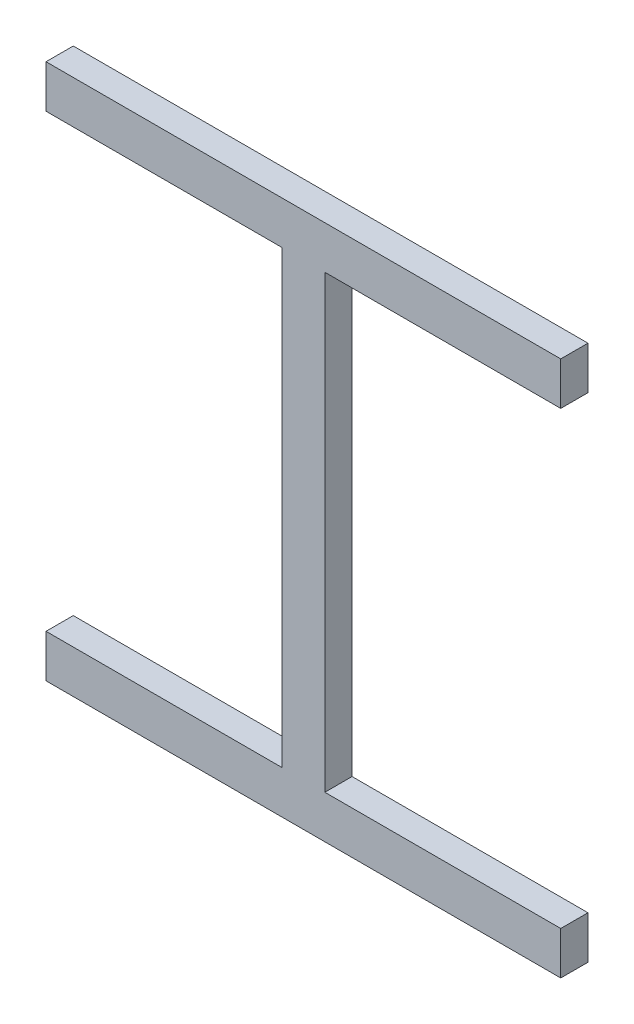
from build123d import *

# Parameters (mm, degrees)
BASESECTION_DEPTH = 12.7


with BuildPart() as part:
    # Sketch1 → BaseSection (new, symmetric)
    with BuildSketch(Plane.XY):
        Polygon((-240, -210), (-240, -250), (240, -250), (240, -210), (20, -210), (20, 210), (240, 210), (240, 250), (-240, 250), (-240, 210), (-20, 210), (-20, -210), align=None)
    extrude(amount=BASESECTION_DEPTH, both=True)


solid = part.part
